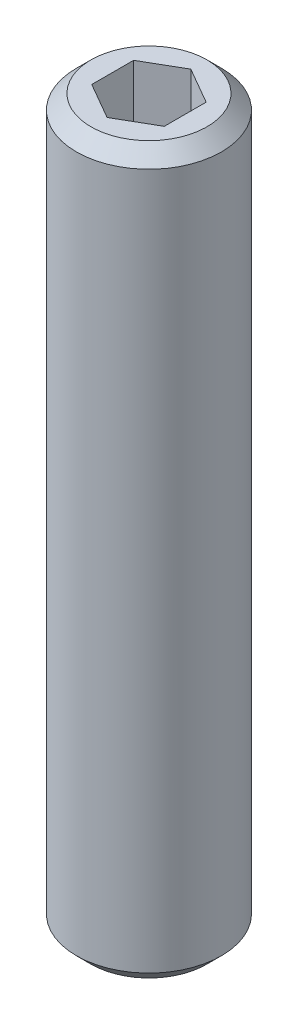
ISO-10303-21;
HEADER;
FILE_DESCRIPTION(('STEP AP214'),'2;1');
FILE_NAME('part.step','',(''),(''),'','','');
FILE_SCHEMA(('AUTOMOTIVE_DESIGN { 1 0 10303 214 1 1 1 1 }'));
ENDSEC;
DATA;
#1=APPLICATION_CONTEXT('core data for automotive mechanical design processes');
#2=APPLICATION_PROTOCOL_DEFINITION('international standard','automotive_design',2000,#1);
#3=PRODUCT_CONTEXT('',#1,'mechanical');
#4=PRODUCT('Part','Part','',(#3));
#5=PRODUCT_RELATED_PRODUCT_CATEGORY('part','',(#4));
#6=PRODUCT_DEFINITION_FORMATION('','',#4);
#7=PRODUCT_DEFINITION_CONTEXT('part definition',#1,'design');
#8=PRODUCT_DEFINITION('design','',#6,#7);
#9=PRODUCT_DEFINITION_SHAPE('','',#8);
#10=(LENGTH_UNIT() NAMED_UNIT(*) SI_UNIT(.MILLI.,.METRE.));
#11=(NAMED_UNIT(*) PLANE_ANGLE_UNIT() SI_UNIT($,.RADIAN.));
#12=(NAMED_UNIT(*) SI_UNIT($,.STERADIAN.) SOLID_ANGLE_UNIT());
#13=UNCERTAINTY_MEASURE_WITH_UNIT(LENGTH_MEASURE(1.E-05),#10,'distance_accuracy_value','');
#14=(GEOMETRIC_REPRESENTATION_CONTEXT(3) GLOBAL_UNCERTAINTY_ASSIGNED_CONTEXT((#13)) GLOBAL_UNIT_ASSIGNED_CONTEXT((#10,
#11,#12)) REPRESENTATION_CONTEXT('',''));
#15=CARTESIAN_POINT('',(0.,0.,0.));
#16=DIRECTION('',(0.,0.,1.));
#17=DIRECTION('',(1.,0.,0.));
#18=AXIS2_PLACEMENT_3D('',#15,#16,#17);
#19=CARTESIAN_POINT('',(0.,-20.,0.));
#20=DIRECTION('',(0.,1.,0.));
#21=DIRECTION('',(0.,0.,1.));
#22=AXIS2_PLACEMENT_3D('',#19,#20,#21);
#23=PLANE('',#22);
#24=CARTESIAN_POINT('',(0.,-20.,0.));
#25=DIRECTION('',(0.,1.,0.));
#26=DIRECTION('',(0.,0.,1.));
#27=AXIS2_PLACEMENT_3D('',#24,#25,#26);
#28=CIRCLE('',#27,1.6);
#29=CARTESIAN_POINT('',(0.,-20.,1.6));
#30=VERTEX_POINT('',#29);
#31=EDGE_CURVE('E139',#30,#30,#28,.F.);
#32=ORIENTED_EDGE('',*,*,#31,.T.);
#33=EDGE_LOOP('',(#32));
#34=FACE_BOUND('',#33,.T.);
#35=ADVANCED_FACE('F28',(#34),#23,.F.);
#36=CARTESIAN_POINT('',(0.,0.,0.));
#37=DIRECTION('',(0.,1.,0.));
#38=DIRECTION('',(0.,0.,1.));
#39=AXIS2_PLACEMENT_3D('',#36,#37,#38);
#40=CYLINDRICAL_SURFACE('',#39,2.);
#41=CARTESIAN_POINT('',(0.,-0.400000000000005,0.));
#42=DIRECTION('',(0.,-1.,0.));
#43=DIRECTION('',(0.,0.,-1.));
#44=AXIS2_PLACEMENT_3D('',#41,#42,#43);
#45=CIRCLE('',#44,2.);
#46=CARTESIAN_POINT('',(0.,-0.400000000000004,-2.00000000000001));
#47=VERTEX_POINT('',#46);
#48=EDGE_CURVE('E11',#47,#47,#45,.T.);
#49=ORIENTED_EDGE('',*,*,#48,.T.);
#50=EDGE_LOOP('',(#49));
#51=FACE_BOUND('',#50,.T.);
#52=CARTESIAN_POINT('',(0.,-19.6,0.));
#53=DIRECTION('',(0.,1.,0.));
#54=DIRECTION('',(0.,0.,1.));
#55=AXIS2_PLACEMENT_3D('',#52,#53,#54);
#56=CIRCLE('',#55,2.);
#57=CARTESIAN_POINT('',(0.,-19.6,2.));
#58=VERTEX_POINT('',#57);
#59=EDGE_CURVE('E130',#58,#58,#56,.T.);
#60=ORIENTED_EDGE('',*,*,#59,.T.);
#61=EDGE_LOOP('',(#60));
#62=FACE_BOUND('',#61,.T.);
#63=ADVANCED_FACE('F160',(#51,#62),#40,.T.);
#64=CARTESIAN_POINT('',(0.,0.,0.));
#65=DIRECTION('',(0.,-1.,0.));
#66=DIRECTION('',(0.,0.,-1.));
#67=AXIS2_PLACEMENT_3D('',#64,#65,#66);
#68=PLANE('',#67);
#69=DIRECTION('',(0.86602540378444,0.,-0.5));
#70=VECTOR('',#69,1.);
#71=CARTESIAN_POINT('',(0.,0.,1.15470053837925));
#72=LINE('',#71,#70);
#73=CARTESIAN_POINT('',(0.,0.,1.15470053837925));
#74=VERTEX_POINT('',#73);
#75=CARTESIAN_POINT('',(1.,0.,0.577350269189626));
#76=VERTEX_POINT('',#75);
#77=EDGE_CURVE('E96',#74,#76,#72,.T.);
#78=ORIENTED_EDGE('',*,*,#77,.F.);
#79=DIRECTION('',(0.86602540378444,0.,0.5));
#80=VECTOR('',#79,1.);
#81=CARTESIAN_POINT('',(-1.,0.,0.577350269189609));
#82=LINE('',#81,#80);
#83=CARTESIAN_POINT('',(-1.,0.,0.577350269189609));
#84=VERTEX_POINT('',#83);
#85=EDGE_CURVE('E42',#84,#74,#82,.T.);
#86=ORIENTED_EDGE('',*,*,#85,.F.);
#87=DIRECTION('',(0.,0.,1.));
#88=VECTOR('',#87,1.);
#89=CARTESIAN_POINT('',(-1.,0.,-0.577350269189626));
#90=LINE('',#89,#88);
#91=CARTESIAN_POINT('',(-1.,0.,-0.577350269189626));
#92=VERTEX_POINT('',#91);
#93=EDGE_CURVE('E112',#92,#84,#90,.T.);
#94=ORIENTED_EDGE('',*,*,#93,.F.);
#95=DIRECTION('',(-0.86602540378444,0.,0.500000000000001));
#96=VECTOR('',#95,1.);
#97=CARTESIAN_POINT('',(0.,0.,-1.15470053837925));
#98=LINE('',#97,#96);
#99=CARTESIAN_POINT('',(0.,0.,-1.15470053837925));
#100=VERTEX_POINT('',#99);
#101=EDGE_CURVE('E106',#100,#92,#98,.T.);
#102=ORIENTED_EDGE('',*,*,#101,.F.);
#103=DIRECTION('',(-0.86602540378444,0.,-0.500000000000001));
#104=VECTOR('',#103,1.);
#105=CARTESIAN_POINT('',(0.999999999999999,0.,-0.577350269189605));
#106=LINE('',#105,#104);
#107=CARTESIAN_POINT('',(0.999999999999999,0.,-0.577350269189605));
#108=VERTEX_POINT('',#107);
#109=EDGE_CURVE('E104',#108,#100,#106,.T.);
#110=ORIENTED_EDGE('',*,*,#109,.F.);
#111=DIRECTION('',(0.,0.,-1.));
#112=VECTOR('',#111,1.);
#113=CARTESIAN_POINT('',(1.,0.,0.577350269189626));
#114=LINE('',#113,#112);
#115=EDGE_CURVE('E85',#76,#108,#114,.T.);
#116=ORIENTED_EDGE('',*,*,#115,.F.);
#117=EDGE_LOOP('',(#78,#86,#94,#102,#110,#116));
#118=FACE_BOUND('',#117,.T.);
#119=CARTESIAN_POINT('',(0.,0.,0.));
#120=DIRECTION('',(0.,-1.,0.));
#121=DIRECTION('',(0.,0.,-1.));
#122=AXIS2_PLACEMENT_3D('',#119,#120,#121);
#123=CIRCLE('',#122,1.6);
#124=CARTESIAN_POINT('',(0.,0.,-1.6));
#125=VERTEX_POINT('',#124);
#126=EDGE_CURVE('E35',#125,#125,#123,.F.);
#127=ORIENTED_EDGE('',*,*,#126,.T.);
#128=EDGE_LOOP('',(#127));
#129=FACE_BOUND('',#128,.T.);
#130=ADVANCED_FACE('F100',(#118,#129),#68,.F.);
#131=CARTESIAN_POINT('',(0.,-19.6,0.));
#132=DIRECTION('',(0.,1.,0.));
#133=DIRECTION('',(0.,0.,1.));
#134=AXIS2_PLACEMENT_3D('',#131,#132,#133);
#135=CONICAL_SURFACE('',#134,2.,0.785398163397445);
#136=ORIENTED_EDGE('',*,*,#31,.F.);
#137=EDGE_LOOP('',(#136));
#138=FACE_BOUND('',#137,.T.);
#139=ORIENTED_EDGE('',*,*,#59,.F.);
#140=EDGE_LOOP('',(#139));
#141=FACE_BOUND('',#140,.T.);
#142=ADVANCED_FACE('F147',(#138,#141),#135,.T.);
#143=CARTESIAN_POINT('',(0.,0.,0.));
#144=DIRECTION('',(0.,-1.,0.));
#145=DIRECTION('',(0.,0.,-1.));
#146=AXIS2_PLACEMENT_3D('',#143,#144,#145);
#147=CONICAL_SURFACE('',#146,1.6,0.785398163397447);
#148=CARTESIAN_POINT('',(0.,-0.400000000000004,-2.00000000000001));
#149=CARTESIAN_POINT('',(0.,-0.395833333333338,-1.99583333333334));
#150=CARTESIAN_POINT('',(0.,-0.391666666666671,-1.99166666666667));
#151=CARTESIAN_POINT('',(0.,-0.383333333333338,-1.98333333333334));
#152=CARTESIAN_POINT('',(0.,-0.379166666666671,-1.97916666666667));
#153=CARTESIAN_POINT('',(0.,-0.370833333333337,-1.97083333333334));
#154=CARTESIAN_POINT('',(0.,-0.366666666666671,-1.96666666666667));
#155=CARTESIAN_POINT('',(0.,-0.358333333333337,-1.95833333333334));
#156=CARTESIAN_POINT('',(0.,-0.354166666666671,-1.95416666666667));
#157=CARTESIAN_POINT('',(0.,-0.345833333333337,-1.94583333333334));
#158=CARTESIAN_POINT('',(0.,-0.34166666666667,-1.94166666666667));
#159=CARTESIAN_POINT('',(0.,-0.333333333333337,-1.93333333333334));
#160=CARTESIAN_POINT('',(0.,-0.32916666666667,-1.92916666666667));
#161=CARTESIAN_POINT('',(0.,-0.320833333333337,-1.92083333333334));
#162=CARTESIAN_POINT('',(0.,-0.31666666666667,-1.91666666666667));
#163=CARTESIAN_POINT('',(0.,-0.308333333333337,-1.90833333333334));
#164=CARTESIAN_POINT('',(0.,-0.30416666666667,-1.90416666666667));
#165=CARTESIAN_POINT('',(0.,-0.295833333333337,-1.89583333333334));
#166=CARTESIAN_POINT('',(0.,-0.29166666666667,-1.89166666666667));
#167=CARTESIAN_POINT('',(0.,-0.283333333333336,-1.88333333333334));
#168=CARTESIAN_POINT('',(0.,-0.27916666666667,-1.87916666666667));
#169=CARTESIAN_POINT('',(0.,-0.270833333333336,-1.87083333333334));
#170=CARTESIAN_POINT('',(0.,-0.26666666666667,-1.86666666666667));
#171=CARTESIAN_POINT('',(0.,-0.258333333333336,-1.85833333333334));
#172=CARTESIAN_POINT('',(0.,-0.254166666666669,-1.85416666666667));
#173=CARTESIAN_POINT('',(0.,-0.245833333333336,-1.84583333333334));
#174=CARTESIAN_POINT('',(0.,-0.241666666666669,-1.84166666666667));
#175=CARTESIAN_POINT('',(0.,-0.233333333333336,-1.83333333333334));
#176=CARTESIAN_POINT('',(0.,-0.229166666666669,-1.82916666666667));
#177=CARTESIAN_POINT('',(0.,-0.220833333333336,-1.82083333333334));
#178=CARTESIAN_POINT('',(0.,-0.216666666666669,-1.81666666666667));
#179=CARTESIAN_POINT('',(0.,-0.208333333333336,-1.80833333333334));
#180=CARTESIAN_POINT('',(0.,-0.204166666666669,-1.80416666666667));
#181=CARTESIAN_POINT('',(0.,-0.195833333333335,-1.79583333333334));
#182=CARTESIAN_POINT('',(0.,-0.191666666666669,-1.79166666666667));
#183=CARTESIAN_POINT('',(0.,-0.183333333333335,-1.78333333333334));
#184=CARTESIAN_POINT('',(0.,-0.179166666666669,-1.77916666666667));
#185=CARTESIAN_POINT('',(0.,-0.170833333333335,-1.77083333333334));
#186=CARTESIAN_POINT('',(0.,-0.166666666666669,-1.76666666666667));
#187=CARTESIAN_POINT('',(0.,-0.158333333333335,-1.75833333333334));
#188=CARTESIAN_POINT('',(0.,-0.154166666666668,-1.75416666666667));
#189=CARTESIAN_POINT('',(0.,-0.145833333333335,-1.74583333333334));
#190=CARTESIAN_POINT('',(0.,-0.141666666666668,-1.74166666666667));
#191=CARTESIAN_POINT('',(0.,-0.133333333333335,-1.73333333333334));
#192=CARTESIAN_POINT('',(0.,-0.129166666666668,-1.72916666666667));
#193=CARTESIAN_POINT('',(0.,-0.120833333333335,-1.72083333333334));
#194=CARTESIAN_POINT('',(0.,-0.116666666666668,-1.71666666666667));
#195=CARTESIAN_POINT('',(0.,-0.108333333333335,-1.70833333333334));
#196=CARTESIAN_POINT('',(0.,-0.104166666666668,-1.70416666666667));
#197=CARTESIAN_POINT('',(0.,-0.0958333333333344,-1.69583333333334));
#198=CARTESIAN_POINT('',(0.,-0.0916666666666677,-1.69166666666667));
#199=CARTESIAN_POINT('',(0.,-0.0833333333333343,-1.68333333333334));
#200=CARTESIAN_POINT('',(0.,-0.0791666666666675,-1.67916666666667));
#201=CARTESIAN_POINT('',(0.,-0.0708333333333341,-1.67083333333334));
#202=CARTESIAN_POINT('',(0.,-0.0666666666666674,-1.66666666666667));
#203=CARTESIAN_POINT('',(0.,-0.058333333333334,-1.65833333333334));
#204=CARTESIAN_POINT('',(0.,-0.0541666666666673,-1.65416666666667));
#205=CARTESIAN_POINT('',(0.,-0.0458333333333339,-1.64583333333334));
#206=CARTESIAN_POINT('',(0.,-0.0416666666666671,-1.64166666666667));
#207=CARTESIAN_POINT('',(0.,-0.0333333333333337,-1.63333333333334));
#208=CARTESIAN_POINT('',(0.,-0.029166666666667,-1.62916666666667));
#209=CARTESIAN_POINT('',(0.,-0.0208333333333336,-1.62083333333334));
#210=CARTESIAN_POINT('',(0.,-0.0166666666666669,-1.61666666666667));
#211=CARTESIAN_POINT('',(0.,-0.00833333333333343,-1.60833333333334));
#212=CARTESIAN_POINT('',(0.,-0.00416666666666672,-1.60416666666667));
#213=CARTESIAN_POINT('',(0.,0.,-1.6));
#214=B_SPLINE_CURVE_WITH_KNOTS('',3,(#148,#149,#150,#151,#152,#153,#154,#155,#156,#157,#158,
#159,#160,#161,#162,#163,#164,#165,#166,#167,#168,#169,#170,#171,#172,#173,#174,#175,#176,#177,
#178,#179,#180,#181,#182,#183,#184,#185,#186,#187,#188,#189,#190,#191,#192,#193,#194,#195,#196,
#197,#198,#199,#200,#201,#202,#203,#204,#205,#206,#207,#208,#209,#210,#211,#212,#213),
.UNSPECIFIED.,.F.,.F.,(4,2,2,2,2,2,2,2,2,2,2,2,2,2,2,2,2,2,2,2,2,2,2,2,2,2,2,2,2,2,2,2,4),(0.,
0.017677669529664,0.0353553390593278,0.0530330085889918,0.0707106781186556,0.0883883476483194,
0.106066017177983,0.123743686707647,0.141421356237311,0.159099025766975,0.176776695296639,
0.194454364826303,0.212132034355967,0.229809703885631,0.247487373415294,0.265165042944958,
0.282842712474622,0.300520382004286,0.31819805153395,0.335875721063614,0.353553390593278,
0.371231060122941,0.388908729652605,0.406586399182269,0.424264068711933,0.441941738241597,
0.459619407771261,0.477297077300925,0.494974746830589,0.512652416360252,0.530330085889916,
0.54800775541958,0.565685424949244),.UNSPECIFIED.);
#215=EDGE_CURVE('BSEAM144',#47,#125,#214,.T.);
#216=ORIENTED_EDGE('',*,*,#48,.F.);
#217=ORIENTED_EDGE('',*,*,#126,.F.);
#218=ORIENTED_EDGE('',*,*,#215,.T.);
#219=ORIENTED_EDGE('',*,*,#215,.F.);
#220=EDGE_LOOP('',(#216,#218,#217,#219));
#221=FACE_BOUND('',#220,.T.);
#222=ADVANCED_FACE('F144',(#221),#147,.T.);
#223=CARTESIAN_POINT('',(-1.,-3.,0.577350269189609));
#224=DIRECTION('',(-0.5,0.,0.86602540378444));
#225=DIRECTION('',(0.86602540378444,0.,0.500000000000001));
#226=AXIS2_PLACEMENT_3D('',#223,#224,#225);
#227=PLANE('',#226);
#228=ORIENTED_EDGE('',*,*,#85,.T.);
#229=DIRECTION('',(0.,1.,0.));
#230=VECTOR('',#229,1.);
#231=CARTESIAN_POINT('',(0.,-3.,1.15470053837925));
#232=LINE('',#231,#230);
#233=CARTESIAN_POINT('',(0.,-3.,1.15470053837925));
#234=VERTEX_POINT('',#233);
#235=EDGE_CURVE('E93',#234,#74,#232,.T.);
#236=ORIENTED_EDGE('',*,*,#235,.F.);
#237=DIRECTION('',(0.86602540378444,0.,0.5));
#238=VECTOR('',#237,1.);
#239=CARTESIAN_POINT('',(-1.,-3.,0.577350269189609));
#240=LINE('',#239,#238);
#241=CARTESIAN_POINT('',(-1.,-3.,0.577350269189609));
#242=VERTEX_POINT('',#241);
#243=EDGE_CURVE('E114',#242,#234,#240,.T.);
#244=ORIENTED_EDGE('',*,*,#243,.F.);
#245=DIRECTION('',(0.,1.,0.));
#246=VECTOR('',#245,1.);
#247=CARTESIAN_POINT('',(-1.,-3.,0.577350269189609));
#248=LINE('',#247,#246);
#249=EDGE_CURVE('E49',#242,#84,#248,.T.);
#250=ORIENTED_EDGE('',*,*,#249,.T.);
#251=EDGE_LOOP('',(#228,#236,#244,#250));
#252=FACE_BOUND('',#251,.T.);
#253=ADVANCED_FACE('F146',(#252),#227,.F.);
#254=CARTESIAN_POINT('',(-1.,-3.,-0.577350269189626));
#255=DIRECTION('',(-1.,0.,0.));
#256=DIRECTION('',(0.,0.,1.));
#257=AXIS2_PLACEMENT_3D('',#254,#255,#256);
#258=PLANE('',#257);
#259=ORIENTED_EDGE('',*,*,#93,.T.);
#260=ORIENTED_EDGE('',*,*,#249,.F.);
#261=DIRECTION('',(0.,0.,1.));
#262=VECTOR('',#261,1.);
#263=CARTESIAN_POINT('',(-1.,-3.,-0.577350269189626));
#264=LINE('',#263,#262);
#265=CARTESIAN_POINT('',(-1.,-3.,-0.577350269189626));
#266=VERTEX_POINT('',#265);
#267=EDGE_CURVE('E126',#266,#242,#264,.T.);
#268=ORIENTED_EDGE('',*,*,#267,.F.);
#269=DIRECTION('',(0.,1.,0.));
#270=VECTOR('',#269,1.);
#271=CARTESIAN_POINT('',(-1.,-3.,-0.577350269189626));
#272=LINE('',#271,#270);
#273=EDGE_CURVE('E131',#266,#92,#272,.T.);
#274=ORIENTED_EDGE('',*,*,#273,.T.);
#275=EDGE_LOOP('',(#259,#260,#268,#274));
#276=FACE_BOUND('',#275,.T.);
#277=ADVANCED_FACE('F154',(#276),#258,.F.);
#278=CARTESIAN_POINT('',(0.,-3.,-1.15470053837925));
#279=DIRECTION('',(-0.500000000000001,0.,-0.86602540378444));
#280=DIRECTION('',(-0.86602540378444,0.,0.500000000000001));
#281=AXIS2_PLACEMENT_3D('',#278,#279,#280);
#282=PLANE('',#281);
#283=ORIENTED_EDGE('',*,*,#101,.T.);
#284=ORIENTED_EDGE('',*,*,#273,.F.);
#285=DIRECTION('',(-0.86602540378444,0.,0.500000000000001));
#286=VECTOR('',#285,1.);
#287=CARTESIAN_POINT('',(0.,-3.,-1.15470053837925));
#288=LINE('',#287,#286);
#289=CARTESIAN_POINT('',(0.,-3.,-1.15470053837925));
#290=VERTEX_POINT('',#289);
#291=EDGE_CURVE('E123',#290,#266,#288,.T.);
#292=ORIENTED_EDGE('',*,*,#291,.F.);
#293=DIRECTION('',(0.,1.,0.));
#294=VECTOR('',#293,1.);
#295=CARTESIAN_POINT('',(0.,-3.,-1.15470053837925));
#296=LINE('',#295,#294);
#297=EDGE_CURVE('E133',#290,#100,#296,.T.);
#298=ORIENTED_EDGE('',*,*,#297,.T.);
#299=EDGE_LOOP('',(#283,#284,#292,#298));
#300=FACE_BOUND('',#299,.T.);
#301=ADVANCED_FACE('F199',(#300),#282,.F.);
#302=CARTESIAN_POINT('',(0.999999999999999,-3.,-0.577350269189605));
#303=DIRECTION('',(0.500000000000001,0.,-0.86602540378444));
#304=DIRECTION('',(-0.86602540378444,0.,-0.500000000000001));
#305=AXIS2_PLACEMENT_3D('',#302,#303,#304);
#306=PLANE('',#305);
#307=ORIENTED_EDGE('',*,*,#109,.T.);
#308=ORIENTED_EDGE('',*,*,#297,.F.);
#309=DIRECTION('',(-0.86602540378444,0.,-0.500000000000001));
#310=VECTOR('',#309,1.);
#311=CARTESIAN_POINT('',(0.999999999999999,-3.,-0.577350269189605));
#312=LINE('',#311,#310);
#313=CARTESIAN_POINT('',(0.999999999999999,-3.,-0.577350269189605));
#314=VERTEX_POINT('',#313);
#315=EDGE_CURVE('E120',#314,#290,#312,.T.);
#316=ORIENTED_EDGE('',*,*,#315,.F.);
#317=DIRECTION('',(0.,1.,0.));
#318=VECTOR('',#317,1.);
#319=CARTESIAN_POINT('',(0.999999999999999,-3.,-0.577350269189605));
#320=LINE('',#319,#318);
#321=EDGE_CURVE('E92',#314,#108,#320,.T.);
#322=ORIENTED_EDGE('',*,*,#321,.T.);
#323=EDGE_LOOP('',(#307,#308,#316,#322));
#324=FACE_BOUND('',#323,.T.);
#325=ADVANCED_FACE('F208',(#324),#306,.F.);
#326=CARTESIAN_POINT('',(1.,-3.,0.577350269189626));
#327=DIRECTION('',(1.,0.,0.));
#328=DIRECTION('',(0.,0.,-1.));
#329=AXIS2_PLACEMENT_3D('',#326,#327,#328);
#330=PLANE('',#329);
#331=ORIENTED_EDGE('',*,*,#115,.T.);
#332=ORIENTED_EDGE('',*,*,#321,.F.);
#333=DIRECTION('',(0.,0.,-1.));
#334=VECTOR('',#333,1.);
#335=CARTESIAN_POINT('',(1.,-3.,0.577350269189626));
#336=LINE('',#335,#334);
#337=CARTESIAN_POINT('',(1.,-3.,0.577350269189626));
#338=VERTEX_POINT('',#337);
#339=EDGE_CURVE('E88',#338,#314,#336,.T.);
#340=ORIENTED_EDGE('',*,*,#339,.F.);
#341=DIRECTION('',(0.,1.,0.));
#342=VECTOR('',#341,1.);
#343=CARTESIAN_POINT('',(1.,-3.,0.577350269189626));
#344=LINE('',#343,#342);
#345=EDGE_CURVE('E81',#338,#76,#344,.T.);
#346=ORIENTED_EDGE('',*,*,#345,.T.);
#347=EDGE_LOOP('',(#331,#332,#340,#346));
#348=FACE_BOUND('',#347,.T.);
#349=ADVANCED_FACE('F83',(#348),#330,.F.);
#350=CARTESIAN_POINT('',(0.,-3.,1.15470053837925));
#351=DIRECTION('',(0.5,0.,0.86602540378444));
#352=DIRECTION('',(0.86602540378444,0.,-0.5));
#353=AXIS2_PLACEMENT_3D('',#350,#351,#352);
#354=PLANE('',#353);
#355=ORIENTED_EDGE('',*,*,#77,.T.);
#356=ORIENTED_EDGE('',*,*,#345,.F.);
#357=DIRECTION('',(0.86602540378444,0.,-0.5));
#358=VECTOR('',#357,1.);
#359=CARTESIAN_POINT('',(0.,-3.,1.15470053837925));
#360=LINE('',#359,#358);
#361=EDGE_CURVE('E117',#234,#338,#360,.T.);
#362=ORIENTED_EDGE('',*,*,#361,.F.);
#363=ORIENTED_EDGE('',*,*,#235,.T.);
#364=EDGE_LOOP('',(#355,#356,#362,#363));
#365=FACE_BOUND('',#364,.T.);
#366=ADVANCED_FACE('F97',(#365),#354,.F.);
#367=CARTESIAN_POINT('',(-1.,-3.,0.577350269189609));
#368=DIRECTION('',(0.,-1.,0.));
#369=DIRECTION('',(0.,0.,-1.));
#370=AXIS2_PLACEMENT_3D('',#367,#368,#369);
#371=PLANE('',#370);
#372=ORIENTED_EDGE('',*,*,#243,.T.);
#373=ORIENTED_EDGE('',*,*,#361,.T.);
#374=ORIENTED_EDGE('',*,*,#339,.T.);
#375=ORIENTED_EDGE('',*,*,#315,.T.);
#376=ORIENTED_EDGE('',*,*,#291,.T.);
#377=ORIENTED_EDGE('',*,*,#267,.T.);
#378=EDGE_LOOP('',(#372,#373,#374,#375,#376,#377));
#379=FACE_BOUND('',#378,.T.);
#380=ADVANCED_FACE('F235',(#379),#371,.F.);
#381=CLOSED_SHELL('',(#35,#63,#130,#142,#222,#253,#277,#301,#325,#349,#366,#380));
#382=MANIFOLD_SOLID_BREP('B2',#381);
#383=ADVANCED_BREP_SHAPE_REPRESENTATION('',(#18,#382),#14);
#384=SHAPE_DEFINITION_REPRESENTATION(#9,#383);
ENDSEC;
END-ISO-10303-21;
